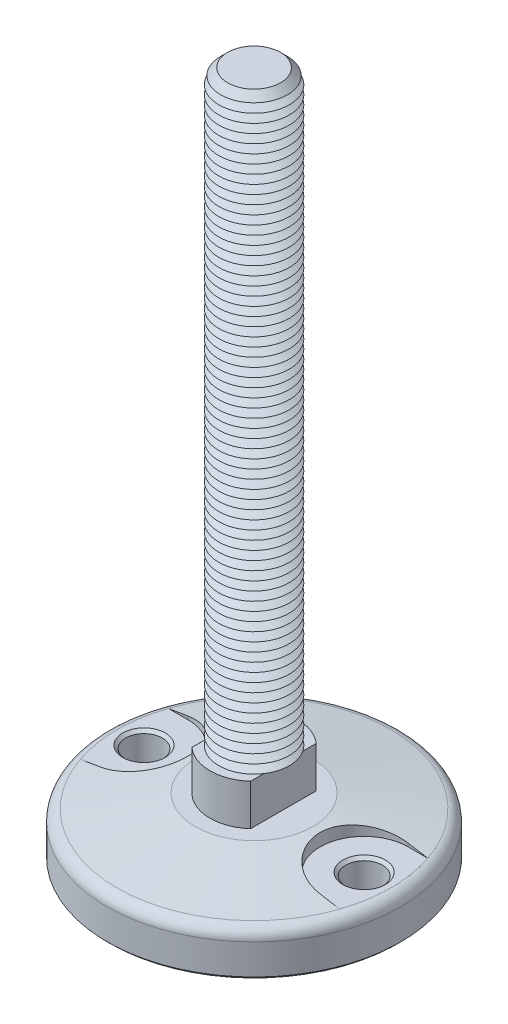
from build123d import *

# Parameters (mm, degrees)
FILLET1_R                = 4
SKETCH3_R                = 15
BOSS_EXTRUDE1_DEPTH      = 14
CUT_EXTRUDE1_START       = -14
CUT_EXTRUDE1_DEPTH       = 14
SKETCH5_R                = 12
BOSS_EXTRUDE2_DEPTH      = 200
CHAMFER1_SIZE            = 3
LPATTERN1_COUNT          = 66
LPATTERN1_PITCH          = 3
CUT_EXTRUDE4_DEPTH       = 4.7
SKETCH10_R               = 6.25
CUT_EXTRUDE5_DEPTH       = 15.3
CHAMFER2_SIZE            = 1
CHAMFER2_OF_MIRROR1_SIZE = 1
CHAMFER3_SIZE            = 1


with BuildPart() as part:
    # Sketch2 → Revolve1 (revolve)
    with BuildSketch(Plane(origin=(0, 0, 0), x_dir=(0, 0, -1), z_dir=(1, 0, 0))):
        Polygon((0, 0), (-20, 0), (-50, -5.289809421), (-50, -20), (0, -20), align=None)
    revolve(axis=Axis((0, 61.338865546, 0), (0, -1, 0)))

    # Fillet1
    fillet1_edges = [part.edges().sort_by_distance(p)[0] for p in [
        (0, -5.289809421, -50),
    ]]
    fillet(fillet1_edges, radius=FILLET1_R)

    # Sketch3 → Boss-Extrude1 (add)
    with BuildSketch(Plane(origin=(0, 0, 0), x_dir=(1, 0, 0), z_dir=(0, 1, 0))):
        with Locations(Location((0, 0, 0), (0, 0, 270))):
            Circle(SKETCH3_R)
    extrude(amount=BOSS_EXTRUDE1_DEPTH)

    # Sketch4 → Cut-Extrude1 (cut)
    with BuildSketch(Plane(origin=(0, 14, 0), x_dir=(1, 0, 0), z_dir=(0, 1, 0)).offset(CUT_EXTRUDE1_START)):
        with BuildLine():
            Line((-10, 11.180339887), (-10, -11.180339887))
            ThreePointArc((-10, -11.180339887), (-15, 0), (-10, 11.180339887))
        make_face()
        with BuildLine():
            Line((10, -11.180339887), (10, 11.180339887))
            ThreePointArc((10, 11.180339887), (15, 0), (10, -11.180339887))
        make_face()
    extrude(amount=CUT_EXTRUDE1_DEPTH, mode=Mode.SUBTRACT)

    # Sketch5 → Boss-Extrude2 (add)
    with BuildSketch(Plane(origin=(0, 14, 0), x_dir=(1, 0, 0), z_dir=(0, 1, 0))):
        with Locations(Location((0, 0, 0), (0, 0, 33.557309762))):
            Circle(SKETCH5_R)
    extrude(amount=BOSS_EXTRUDE2_DEPTH)

    # Chamfer1
    chamfer1_edges = [part.edges().sort_by_distance(p)[0] for p in [
        (-10, 214, 6.633249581),
    ]]
    chamfer(chamfer1_edges, length=CHAMFER1_SIZE)

    # Sketch6 → Cut-Revolve1 (revolve, cut)
    with BuildSketch(Plane(origin=(0, 0, 0), x_dir=(0, 0, -1), z_dir=(1, 0, 0))):
        Polygon((-12, 14), (-9.401923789, 15.5), (-12, 17), align=None)
    cut_revolve1 = revolve(axis=Axis((0, 61.338865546, 0), (0, -1, 0)), mode=Mode.SUBTRACT)

    # LPattern1: Cut-Revolve1 ×66
    with Locations(*[(0, i * LPATTERN1_PITCH, 0) for i in range(1, LPATTERN1_COUNT)]):
        add(cut_revolve1, mode=Mode.SUBTRACT)

    # Sketch8 → Cut-Extrude4 (cut)
    with BuildSketch(Plane(origin=(0, 0, 0), x_dir=(1, 0, 0), z_dir=(0, 1, 0))):
        with BuildLine():
            Line((-37.5, 15), (-44.219735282, 15))
            ThreePointArc((-44.219735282, 15), (-46.694592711, 0), (-44.219735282, -15))
            Line((-44.219735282, -15), (-37.5, -15))
            ThreePointArc((-37.5, -15), (-22.5, 0), (-37.5, 15))
        make_face()
    cut_extrude4 = extrude(amount=-CUT_EXTRUDE4_DEPTH, mode=Mode.SUBTRACT)

    # Sketch10 → Cut-Extrude5 (cut)
    with BuildSketch(Plane(origin=(0, -4.7, 0), x_dir=(1, 0, 0), z_dir=(0, 1, 0))):
        with Locations(Location((-37.5, 0, 0), (0, 0, 270))):
            Circle(SKETCH10_R)
    cut_extrude5 = extrude(amount=-CUT_EXTRUDE5_DEPTH, mode=Mode.SUBTRACT)

    # Chamfer2
    chamfer2_edges = [part.edges().sort_by_distance(p)[0] for p in [
        (-37.5, -4.7, -6.25),
        (-37.5, -20, -6.25),
    ]]
    chamfer(chamfer2_edges, length=CHAMFER2_SIZE)

    # Mirror1: Cut-Extrude4, Cut-Extrude5 across plane
    add(cut_extrude4.mirror(Plane(origin=(0, 0, 0), x_dir=(0, 0, 1), z_dir=(1, 0, 0))), mode=Mode.SUBTRACT)
    add(cut_extrude5.mirror(Plane(origin=(0, 0, 0), x_dir=(0, 0, 1), z_dir=(1, 0, 0))), mode=Mode.SUBTRACT)

    # Chamfer2 of Mirror1
    chamfer2_of_mirror1_edges = [part.edges().sort_by_distance(p)[0] for p in [
        (37.5, -4.7, -6.25),
        (37.5, -20, -6.25),
    ]]
    chamfer(chamfer2_of_mirror1_edges, length=CHAMFER2_OF_MIRROR1_SIZE)

    # Chamfer3
    chamfer3_edges = [part.edges().sort_by_distance(p)[0] for p in [
        (0, -20, -50),
    ]]
    chamfer(chamfer3_edges, length=CHAMFER3_SIZE)


solid = part.part
